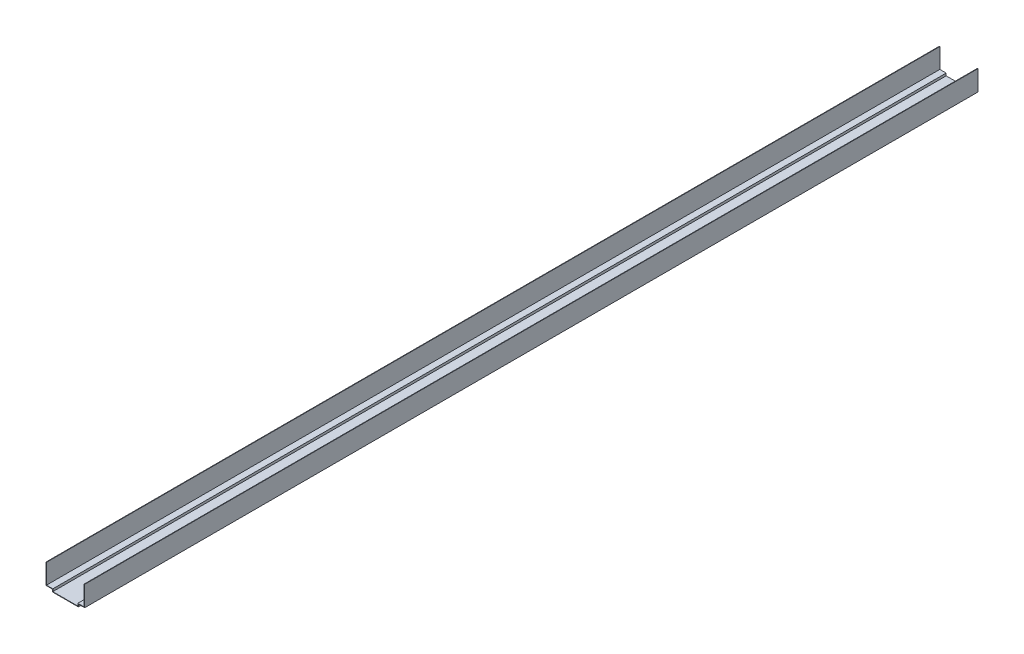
ISO-10303-21;
HEADER;
FILE_DESCRIPTION(('STEP AP214'),'2;1');
FILE_NAME('part.step','',(''),(''),'','','');
FILE_SCHEMA(('AUTOMOTIVE_DESIGN { 1 0 10303 214 1 1 1 1 }'));
ENDSEC;
DATA;
#1=APPLICATION_CONTEXT('core data for automotive mechanical design processes');
#2=APPLICATION_PROTOCOL_DEFINITION('international standard','automotive_design',2000,#1);
#3=PRODUCT_CONTEXT('',#1,'mechanical');
#4=PRODUCT('Part','Part','',(#3));
#5=PRODUCT_RELATED_PRODUCT_CATEGORY('part','',(#4));
#6=PRODUCT_DEFINITION_FORMATION('','',#4);
#7=PRODUCT_DEFINITION_CONTEXT('part definition',#1,'design');
#8=PRODUCT_DEFINITION('design','',#6,#7);
#9=PRODUCT_DEFINITION_SHAPE('','',#8);
#10=(LENGTH_UNIT() NAMED_UNIT(*) SI_UNIT(.MILLI.,.METRE.));
#11=(NAMED_UNIT(*) PLANE_ANGLE_UNIT() SI_UNIT($,.RADIAN.));
#12=(NAMED_UNIT(*) SI_UNIT($,.STERADIAN.) SOLID_ANGLE_UNIT());
#13=UNCERTAINTY_MEASURE_WITH_UNIT(LENGTH_MEASURE(1.E-05),#10,'distance_accuracy_value','');
#14=(GEOMETRIC_REPRESENTATION_CONTEXT(3) GLOBAL_UNCERTAINTY_ASSIGNED_CONTEXT((#13)) GLOBAL_UNIT_ASSIGNED_CONTEXT((#10,
#11,#12)) REPRESENTATION_CONTEXT('',''));
#15=CARTESIAN_POINT('',(0.,0.,0.));
#16=DIRECTION('',(0.,0.,1.));
#17=DIRECTION('',(1.,0.,0.));
#18=AXIS2_PLACEMENT_3D('',#15,#16,#17);
#19=CARTESIAN_POINT('',(-119.,140.01,-5500.));
#20=DIRECTION('',(0.,1.,0.));
#21=DIRECTION('',(0.,0.,1.));
#22=AXIS2_PLACEMENT_3D('',#19,#20,#21);
#23=PLANE('',#22);
#24=DIRECTION('',(-1.,0.,0.));
#25=VECTOR('',#24,1.);
#26=CARTESIAN_POINT('',(-119.,140.01,0.));
#27=LINE('',#26,#25);
#28=CARTESIAN_POINT('',(-116.,140.01,0.));
#29=VERTEX_POINT('',#28);
#30=CARTESIAN_POINT('',(-119.,140.01,0.));
#31=VERTEX_POINT('',#30);
#32=EDGE_CURVE('E194',#29,#31,#27,.T.);
#33=ORIENTED_EDGE('',*,*,#32,.F.);
#34=DIRECTION('',(0.,0.,1.));
#35=VECTOR('',#34,1.);
#36=CARTESIAN_POINT('',(-116.,140.01,-5500.));
#37=LINE('',#36,#35);
#38=CARTESIAN_POINT('',(-116.,140.01,-5500.));
#39=VERTEX_POINT('',#38);
#40=EDGE_CURVE('E11',#39,#29,#37,.T.);
#41=ORIENTED_EDGE('',*,*,#40,.F.);
#42=DIRECTION('',(-1.,0.,0.));
#43=VECTOR('',#42,1.);
#44=CARTESIAN_POINT('',(-119.,140.01,-5500.));
#45=LINE('',#44,#43);
#46=CARTESIAN_POINT('',(-119.,140.01,-5500.));
#47=VERTEX_POINT('',#46);
#48=EDGE_CURVE('E244',#39,#47,#45,.T.);
#49=ORIENTED_EDGE('',*,*,#48,.T.);
#50=DIRECTION('',(0.,0.,1.));
#51=VECTOR('',#50,1.);
#52=CARTESIAN_POINT('',(-119.,140.01,-5500.));
#53=LINE('',#52,#51);
#54=EDGE_CURVE('E46',#47,#31,#53,.T.);
#55=ORIENTED_EDGE('',*,*,#54,.T.);
#56=EDGE_LOOP('',(#33,#41,#49,#55));
#57=FACE_BOUND('',#56,.T.);
#58=ADVANCED_FACE('F43',(#57),#23,.T.);
#59=CARTESIAN_POINT('',(-116.,140.01,-5500.));
#60=DIRECTION('',(1.,0.,0.));
#61=DIRECTION('',(0.,1.,0.));
#62=AXIS2_PLACEMENT_3D('',#59,#60,#61);
#63=PLANE('',#62);
#64=DIRECTION('',(0.,1.,0.));
#65=VECTOR('',#64,1.);
#66=CARTESIAN_POINT('',(-116.,140.01,0.));
#67=LINE('',#66,#65);
#68=CARTESIAN_POINT('',(-116.,18.,0.));
#69=VERTEX_POINT('',#68);
#70=EDGE_CURVE('E241',#69,#29,#67,.T.);
#71=ORIENTED_EDGE('',*,*,#70,.F.);
#72=DIRECTION('',(0.,0.,1.));
#73=VECTOR('',#72,1.);
#74=CARTESIAN_POINT('',(-116.,18.,-5500.));
#75=LINE('',#74,#73);
#76=CARTESIAN_POINT('',(-116.,18.,-5500.));
#77=VERTEX_POINT('',#76);
#78=EDGE_CURVE('E53',#77,#69,#75,.T.);
#79=ORIENTED_EDGE('',*,*,#78,.F.);
#80=DIRECTION('',(0.,1.,0.));
#81=VECTOR('',#80,1.);
#82=CARTESIAN_POINT('',(-116.,140.01,-5500.));
#83=LINE('',#82,#81);
#84=EDGE_CURVE('E184',#77,#39,#83,.T.);
#85=ORIENTED_EDGE('',*,*,#84,.T.);
#86=ORIENTED_EDGE('',*,*,#40,.T.);
#87=EDGE_LOOP('',(#71,#79,#85,#86));
#88=FACE_BOUND('',#87,.T.);
#89=ADVANCED_FACE('F286',(#88),#63,.T.);
#90=CARTESIAN_POINT('',(-116.,18.,-5500.));
#91=DIRECTION('',(0.,1.,0.));
#92=DIRECTION('',(0.,0.,1.));
#93=AXIS2_PLACEMENT_3D('',#90,#91,#92);
#94=PLANE('',#93);
#95=DIRECTION('',(-1.,0.,0.));
#96=VECTOR('',#95,1.);
#97=CARTESIAN_POINT('',(-116.,18.,0.));
#98=LINE('',#97,#96);
#99=CARTESIAN_POINT('',(-77.,18.,0.));
#100=VERTEX_POINT('',#99);
#101=EDGE_CURVE('E170',#100,#69,#98,.T.);
#102=ORIENTED_EDGE('',*,*,#101,.F.);
#103=DIRECTION('',(0.,0.,1.));
#104=VECTOR('',#103,1.);
#105=CARTESIAN_POINT('',(-77.,18.,-5500.));
#106=LINE('',#105,#104);
#107=CARTESIAN_POINT('',(-77.,18.,-5500.));
#108=VERTEX_POINT('',#107);
#109=EDGE_CURVE('E165',#108,#100,#106,.T.);
#110=ORIENTED_EDGE('',*,*,#109,.F.);
#111=DIRECTION('',(-1.,0.,0.));
#112=VECTOR('',#111,1.);
#113=CARTESIAN_POINT('',(-116.,18.,-5500.));
#114=LINE('',#113,#112);
#115=EDGE_CURVE('E168',#108,#77,#114,.T.);
#116=ORIENTED_EDGE('',*,*,#115,.T.);
#117=ORIENTED_EDGE('',*,*,#78,.T.);
#118=EDGE_LOOP('',(#102,#110,#116,#117));
#119=FACE_BOUND('',#118,.T.);
#120=ADVANCED_FACE('F167',(#119),#94,.T.);
#121=CARTESIAN_POINT('',(-77.,18.,-5500.));
#122=DIRECTION('',(1.,0.,0.));
#123=DIRECTION('',(0.,0.,-1.));
#124=AXIS2_PLACEMENT_3D('',#121,#122,#123);
#125=PLANE('',#124);
#126=DIRECTION('',(0.,1.,0.));
#127=VECTOR('',#126,1.);
#128=CARTESIAN_POINT('',(-77.,18.,0.));
#129=LINE('',#128,#127);
#130=CARTESIAN_POINT('',(-77.,3.,0.));
#131=VERTEX_POINT('',#130);
#132=EDGE_CURVE('E238',#131,#100,#129,.T.);
#133=ORIENTED_EDGE('',*,*,#132,.F.);
#134=DIRECTION('',(0.,0.,1.));
#135=VECTOR('',#134,1.);
#136=CARTESIAN_POINT('',(-77.,3.,-5500.));
#137=LINE('',#136,#135);
#138=CARTESIAN_POINT('',(-77.,3.,-5500.));
#139=VERTEX_POINT('',#138);
#140=EDGE_CURVE('E176',#139,#131,#137,.T.);
#141=ORIENTED_EDGE('',*,*,#140,.F.);
#142=DIRECTION('',(0.,1.,0.));
#143=VECTOR('',#142,1.);
#144=CARTESIAN_POINT('',(-77.,18.,-5500.));
#145=LINE('',#144,#143);
#146=EDGE_CURVE('E182',#139,#108,#145,.T.);
#147=ORIENTED_EDGE('',*,*,#146,.T.);
#148=ORIENTED_EDGE('',*,*,#109,.T.);
#149=EDGE_LOOP('',(#133,#141,#147,#148));
#150=FACE_BOUND('',#149,.T.);
#151=ADVANCED_FACE('F186',(#150),#125,.T.);
#152=CARTESIAN_POINT('',(-77.,3.,-5500.));
#153=DIRECTION('',(0.,1.,0.));
#154=DIRECTION('',(-1.,0.,0.));
#155=AXIS2_PLACEMENT_3D('',#152,#153,#154);
#156=PLANE('',#155);
#157=DIRECTION('',(-1.,0.,0.));
#158=VECTOR('',#157,1.);
#159=CARTESIAN_POINT('',(-77.,3.,0.));
#160=LINE('',#159,#158);
#161=CARTESIAN_POINT('',(77.,3.,0.));
#162=VERTEX_POINT('',#161);
#163=EDGE_CURVE('E235',#162,#131,#160,.T.);
#164=ORIENTED_EDGE('',*,*,#163,.F.);
#165=DIRECTION('',(0.,0.,1.));
#166=VECTOR('',#165,1.);
#167=CARTESIAN_POINT('',(77.,3.,-5500.));
#168=LINE('',#167,#166);
#169=CARTESIAN_POINT('',(77.,3.,-5500.));
#170=VERTEX_POINT('',#169);
#171=EDGE_CURVE('E250',#170,#162,#168,.T.);
#172=ORIENTED_EDGE('',*,*,#171,.F.);
#173=DIRECTION('',(-1.,0.,0.));
#174=VECTOR('',#173,1.);
#175=CARTESIAN_POINT('',(-77.,3.,-5500.));
#176=LINE('',#175,#174);
#177=EDGE_CURVE('E187',#170,#139,#176,.T.);
#178=ORIENTED_EDGE('',*,*,#177,.T.);
#179=ORIENTED_EDGE('',*,*,#140,.T.);
#180=EDGE_LOOP('',(#164,#172,#178,#179));
#181=FACE_BOUND('',#180,.T.);
#182=ADVANCED_FACE('F299',(#181),#156,.T.);
#183=CARTESIAN_POINT('',(77.,18.,-5500.));
#184=DIRECTION('',(-1.,0.,0.));
#185=DIRECTION('',(0.,0.,1.));
#186=AXIS2_PLACEMENT_3D('',#183,#184,#185);
#187=PLANE('',#186);
#188=DIRECTION('',(0.,-1.,0.));
#189=VECTOR('',#188,1.);
#190=CARTESIAN_POINT('',(77.,18.,0.));
#191=LINE('',#190,#189);
#192=CARTESIAN_POINT('',(77.,18.,0.));
#193=VERTEX_POINT('',#192);
#194=EDGE_CURVE('E232',#193,#162,#191,.T.);
#195=ORIENTED_EDGE('',*,*,#194,.F.);
#196=DIRECTION('',(0.,0.,1.));
#197=VECTOR('',#196,1.);
#198=CARTESIAN_POINT('',(77.,18.,-5500.));
#199=LINE('',#198,#197);
#200=CARTESIAN_POINT('',(77.,18.,-5500.));
#201=VERTEX_POINT('',#200);
#202=EDGE_CURVE('E253',#201,#193,#199,.T.);
#203=ORIENTED_EDGE('',*,*,#202,.F.);
#204=DIRECTION('',(0.,-1.,0.));
#205=VECTOR('',#204,1.);
#206=CARTESIAN_POINT('',(77.,18.,-5500.));
#207=LINE('',#206,#205);
#208=EDGE_CURVE('E189',#201,#170,#207,.T.);
#209=ORIENTED_EDGE('',*,*,#208,.T.);
#210=ORIENTED_EDGE('',*,*,#171,.T.);
#211=EDGE_LOOP('',(#195,#203,#209,#210));
#212=FACE_BOUND('',#211,.T.);
#213=ADVANCED_FACE('F302',(#212),#187,.T.);
#214=CARTESIAN_POINT('',(116.,18.,-5500.));
#215=DIRECTION('',(0.,1.,0.));
#216=DIRECTION('',(-1.,0.,0.));
#217=AXIS2_PLACEMENT_3D('',#214,#215,#216);
#218=PLANE('',#217);
#219=DIRECTION('',(-1.,0.,0.));
#220=VECTOR('',#219,1.);
#221=CARTESIAN_POINT('',(116.,18.,0.));
#222=LINE('',#221,#220);
#223=CARTESIAN_POINT('',(116.,18.,0.));
#224=VERTEX_POINT('',#223);
#225=EDGE_CURVE('E229',#224,#193,#222,.T.);
#226=ORIENTED_EDGE('',*,*,#225,.F.);
#227=DIRECTION('',(0.,0.,1.));
#228=VECTOR('',#227,1.);
#229=CARTESIAN_POINT('',(116.,18.,-5500.));
#230=LINE('',#229,#228);
#231=CARTESIAN_POINT('',(116.,18.,-5500.));
#232=VERTEX_POINT('',#231);
#233=EDGE_CURVE('E256',#232,#224,#230,.T.);
#234=ORIENTED_EDGE('',*,*,#233,.F.);
#235=DIRECTION('',(-1.,0.,0.));
#236=VECTOR('',#235,1.);
#237=CARTESIAN_POINT('',(116.,18.,-5500.));
#238=LINE('',#237,#236);
#239=EDGE_CURVE('E487',#232,#201,#238,.T.);
#240=ORIENTED_EDGE('',*,*,#239,.T.);
#241=ORIENTED_EDGE('',*,*,#202,.T.);
#242=EDGE_LOOP('',(#226,#234,#240,#241));
#243=FACE_BOUND('',#242,.T.);
#244=ADVANCED_FACE('F306',(#243),#218,.T.);
#245=CARTESIAN_POINT('',(116.,140.01,-5500.));
#246=DIRECTION('',(-1.,0.,0.));
#247=DIRECTION('',(0.,-1.,0.));
#248=AXIS2_PLACEMENT_3D('',#245,#246,#247);
#249=PLANE('',#248);
#250=DIRECTION('',(0.,-1.,0.));
#251=VECTOR('',#250,1.);
#252=CARTESIAN_POINT('',(116.,140.01,0.));
#253=LINE('',#252,#251);
#254=CARTESIAN_POINT('',(116.,140.01,0.));
#255=VERTEX_POINT('',#254);
#256=EDGE_CURVE('E225',#255,#224,#253,.T.);
#257=ORIENTED_EDGE('',*,*,#256,.F.);
#258=DIRECTION('',(0.,0.,1.));
#259=VECTOR('',#258,1.);
#260=CARTESIAN_POINT('',(116.,140.01,-5500.));
#261=LINE('',#260,#259);
#262=CARTESIAN_POINT('',(116.,140.01,-5500.));
#263=VERTEX_POINT('',#262);
#264=EDGE_CURVE('E259',#263,#255,#261,.T.);
#265=ORIENTED_EDGE('',*,*,#264,.F.);
#266=DIRECTION('',(0.,-1.,0.));
#267=VECTOR('',#266,1.);
#268=CARTESIAN_POINT('',(116.,140.01,-5500.));
#269=LINE('',#268,#267);
#270=EDGE_CURVE('E483',#263,#232,#269,.T.);
#271=ORIENTED_EDGE('',*,*,#270,.T.);
#272=ORIENTED_EDGE('',*,*,#233,.T.);
#273=EDGE_LOOP('',(#257,#265,#271,#272));
#274=FACE_BOUND('',#273,.T.);
#275=ADVANCED_FACE('F310',(#274),#249,.T.);
#276=CARTESIAN_POINT('',(116.,140.01,-5500.));
#277=DIRECTION('',(0.,1.,0.));
#278=DIRECTION('',(0.,0.,1.));
#279=AXIS2_PLACEMENT_3D('',#276,#277,#278);
#280=PLANE('',#279);
#281=DIRECTION('',(-1.,0.,0.));
#282=VECTOR('',#281,1.);
#283=CARTESIAN_POINT('',(116.,140.01,0.));
#284=LINE('',#283,#282);
#285=CARTESIAN_POINT('',(119.,140.01,0.));
#286=VERTEX_POINT('',#285);
#287=EDGE_CURVE('E221',#286,#255,#284,.T.);
#288=ORIENTED_EDGE('',*,*,#287,.F.);
#289=DIRECTION('',(0.,0.,1.));
#290=VECTOR('',#289,1.);
#291=CARTESIAN_POINT('',(119.,140.01,-5500.));
#292=LINE('',#291,#290);
#293=CARTESIAN_POINT('',(119.,140.01,-5500.));
#294=VERTEX_POINT('',#293);
#295=EDGE_CURVE('E262',#294,#286,#292,.T.);
#296=ORIENTED_EDGE('',*,*,#295,.F.);
#297=DIRECTION('',(-1.,0.,0.));
#298=VECTOR('',#297,1.);
#299=CARTESIAN_POINT('',(116.,140.01,-5500.));
#300=LINE('',#299,#298);
#301=EDGE_CURVE('E494',#294,#263,#300,.T.);
#302=ORIENTED_EDGE('',*,*,#301,.T.);
#303=ORIENTED_EDGE('',*,*,#264,.T.);
#304=EDGE_LOOP('',(#288,#296,#302,#303));
#305=FACE_BOUND('',#304,.T.);
#306=ADVANCED_FACE('F314',(#305),#280,.T.);
#307=CARTESIAN_POINT('',(119.,140.01,-5500.));
#308=DIRECTION('',(1.,0.,0.));
#309=DIRECTION('',(0.,1.,0.));
#310=AXIS2_PLACEMENT_3D('',#307,#308,#309);
#311=PLANE('',#310);
#312=DIRECTION('',(0.,1.,0.));
#313=VECTOR('',#312,1.);
#314=CARTESIAN_POINT('',(119.,140.01,0.));
#315=LINE('',#314,#313);
#316=CARTESIAN_POINT('',(119.,15.,0.));
#317=VERTEX_POINT('',#316);
#318=EDGE_CURVE('E217',#317,#286,#315,.T.);
#319=ORIENTED_EDGE('',*,*,#318,.F.);
#320=DIRECTION('',(0.,0.,1.));
#321=VECTOR('',#320,1.);
#322=CARTESIAN_POINT('',(119.,15.,-5500.));
#323=LINE('',#322,#321);
#324=CARTESIAN_POINT('',(119.,15.,-5500.));
#325=VERTEX_POINT('',#324);
#326=EDGE_CURVE('E265',#325,#317,#323,.T.);
#327=ORIENTED_EDGE('',*,*,#326,.F.);
#328=DIRECTION('',(0.,1.,0.));
#329=VECTOR('',#328,1.);
#330=CARTESIAN_POINT('',(119.,140.01,-5500.));
#331=LINE('',#330,#329);
#332=EDGE_CURVE('E476',#325,#294,#331,.T.);
#333=ORIENTED_EDGE('',*,*,#332,.T.);
#334=ORIENTED_EDGE('',*,*,#295,.T.);
#335=EDGE_LOOP('',(#319,#327,#333,#334));
#336=FACE_BOUND('',#335,.T.);
#337=ADVANCED_FACE('F318',(#336),#311,.T.);
#338=CARTESIAN_POINT('',(119.,15.,-5500.));
#339=DIRECTION('',(0.,-1.,0.));
#340=DIRECTION('',(1.,0.,0.));
#341=AXIS2_PLACEMENT_3D('',#338,#339,#340);
#342=PLANE('',#341);
#343=DIRECTION('',(1.,0.,0.));
#344=VECTOR('',#343,1.);
#345=CARTESIAN_POINT('',(119.,15.,0.));
#346=LINE('',#345,#344);
#347=CARTESIAN_POINT('',(80.,15.,0.));
#348=VERTEX_POINT('',#347);
#349=EDGE_CURVE('E214',#348,#317,#346,.T.);
#350=ORIENTED_EDGE('',*,*,#349,.F.);
#351=DIRECTION('',(0.,0.,1.));
#352=VECTOR('',#351,1.);
#353=CARTESIAN_POINT('',(80.,15.,-5500.));
#354=LINE('',#353,#352);
#355=CARTESIAN_POINT('',(80.,15.,-5500.));
#356=VERTEX_POINT('',#355);
#357=EDGE_CURVE('E268',#356,#348,#354,.T.);
#358=ORIENTED_EDGE('',*,*,#357,.F.);
#359=DIRECTION('',(1.,0.,0.));
#360=VECTOR('',#359,1.);
#361=CARTESIAN_POINT('',(119.,15.,-5500.));
#362=LINE('',#361,#360);
#363=EDGE_CURVE('E472',#356,#325,#362,.T.);
#364=ORIENTED_EDGE('',*,*,#363,.T.);
#365=ORIENTED_EDGE('',*,*,#326,.T.);
#366=EDGE_LOOP('',(#350,#358,#364,#365));
#367=FACE_BOUND('',#366,.T.);
#368=ADVANCED_FACE('F322',(#367),#342,.T.);
#369=CARTESIAN_POINT('',(80.,15.,-5500.));
#370=DIRECTION('',(1.,0.,0.));
#371=DIRECTION('',(0.,0.,-1.));
#372=AXIS2_PLACEMENT_3D('',#369,#370,#371);
#373=PLANE('',#372);
#374=DIRECTION('',(0.,1.,0.));
#375=VECTOR('',#374,1.);
#376=CARTESIAN_POINT('',(80.,15.,0.));
#377=LINE('',#376,#375);
#378=CARTESIAN_POINT('',(80.,0.,0.));
#379=VERTEX_POINT('',#378);
#380=EDGE_CURVE('E211',#379,#348,#377,.T.);
#381=ORIENTED_EDGE('',*,*,#380,.F.);
#382=DIRECTION('',(0.,0.,1.));
#383=VECTOR('',#382,1.);
#384=CARTESIAN_POINT('',(80.,0.,-5500.));
#385=LINE('',#384,#383);
#386=CARTESIAN_POINT('',(80.,0.,-5500.));
#387=VERTEX_POINT('',#386);
#388=EDGE_CURVE('E271',#387,#379,#385,.T.);
#389=ORIENTED_EDGE('',*,*,#388,.F.);
#390=DIRECTION('',(0.,1.,0.));
#391=VECTOR('',#390,1.);
#392=CARTESIAN_POINT('',(80.,15.,-5500.));
#393=LINE('',#392,#391);
#394=EDGE_CURVE('E498',#387,#356,#393,.T.);
#395=ORIENTED_EDGE('',*,*,#394,.T.);
#396=ORIENTED_EDGE('',*,*,#357,.T.);
#397=EDGE_LOOP('',(#381,#389,#395,#396));
#398=FACE_BOUND('',#397,.T.);
#399=ADVANCED_FACE('F326',(#398),#373,.T.);
#400=CARTESIAN_POINT('',(-80.,0.,-5500.));
#401=DIRECTION('',(0.,-1.,0.));
#402=DIRECTION('',(1.,0.,0.));
#403=AXIS2_PLACEMENT_3D('',#400,#401,#402);
#404=PLANE('',#403);
#405=DIRECTION('',(1.,0.,0.));
#406=VECTOR('',#405,1.);
#407=CARTESIAN_POINT('',(-80.,0.,0.));
#408=LINE('',#407,#406);
#409=CARTESIAN_POINT('',(-80.,0.,0.));
#410=VERTEX_POINT('',#409);
#411=EDGE_CURVE('E208',#410,#379,#408,.T.);
#412=ORIENTED_EDGE('',*,*,#411,.F.);
#413=DIRECTION('',(0.,0.,1.));
#414=VECTOR('',#413,1.);
#415=CARTESIAN_POINT('',(-80.,0.,-5500.));
#416=LINE('',#415,#414);
#417=CARTESIAN_POINT('',(-80.,0.,-5500.));
#418=VERTEX_POINT('',#417);
#419=EDGE_CURVE('E274',#418,#410,#416,.T.);
#420=ORIENTED_EDGE('',*,*,#419,.F.);
#421=DIRECTION('',(1.,0.,0.));
#422=VECTOR('',#421,1.);
#423=CARTESIAN_POINT('',(-80.,0.,-5500.));
#424=LINE('',#423,#422);
#425=EDGE_CURVE('E465',#418,#387,#424,.T.);
#426=ORIENTED_EDGE('',*,*,#425,.T.);
#427=ORIENTED_EDGE('',*,*,#388,.T.);
#428=EDGE_LOOP('',(#412,#420,#426,#427));
#429=FACE_BOUND('',#428,.T.);
#430=ADVANCED_FACE('F330',(#429),#404,.T.);
#431=CARTESIAN_POINT('',(-80.,15.,-5500.));
#432=DIRECTION('',(-1.,0.,0.));
#433=DIRECTION('',(0.,0.,1.));
#434=AXIS2_PLACEMENT_3D('',#431,#432,#433);
#435=PLANE('',#434);
#436=DIRECTION('',(0.,-1.,0.));
#437=VECTOR('',#436,1.);
#438=CARTESIAN_POINT('',(-80.,15.,0.));
#439=LINE('',#438,#437);
#440=CARTESIAN_POINT('',(-80.,15.,0.));
#441=VERTEX_POINT('',#440);
#442=EDGE_CURVE('E205',#441,#410,#439,.T.);
#443=ORIENTED_EDGE('',*,*,#442,.F.);
#444=DIRECTION('',(0.,0.,1.));
#445=VECTOR('',#444,1.);
#446=CARTESIAN_POINT('',(-80.,15.,-5500.));
#447=LINE('',#446,#445);
#448=CARTESIAN_POINT('',(-80.,15.,-5500.));
#449=VERTEX_POINT('',#448);
#450=EDGE_CURVE('E277',#449,#441,#447,.T.);
#451=ORIENTED_EDGE('',*,*,#450,.F.);
#452=DIRECTION('',(0.,-1.,0.));
#453=VECTOR('',#452,1.);
#454=CARTESIAN_POINT('',(-80.,15.,-5500.));
#455=LINE('',#454,#453);
#456=EDGE_CURVE('E461',#449,#418,#455,.T.);
#457=ORIENTED_EDGE('',*,*,#456,.T.);
#458=ORIENTED_EDGE('',*,*,#419,.T.);
#459=EDGE_LOOP('',(#443,#451,#457,#458));
#460=FACE_BOUND('',#459,.T.);
#461=ADVANCED_FACE('F334',(#460),#435,.T.);
#462=CARTESIAN_POINT('',(-119.,15.,-5500.));
#463=DIRECTION('',(0.,-1.,0.));
#464=DIRECTION('',(0.,0.,-1.));
#465=AXIS2_PLACEMENT_3D('',#462,#463,#464);
#466=PLANE('',#465);
#467=DIRECTION('',(1.,0.,0.));
#468=VECTOR('',#467,1.);
#469=CARTESIAN_POINT('',(-119.,15.,0.));
#470=LINE('',#469,#468);
#471=CARTESIAN_POINT('',(-119.,15.,0.));
#472=VERTEX_POINT('',#471);
#473=EDGE_CURVE('E202',#472,#441,#470,.T.);
#474=ORIENTED_EDGE('',*,*,#473,.F.);
#475=DIRECTION('',(0.,0.,1.));
#476=VECTOR('',#475,1.);
#477=CARTESIAN_POINT('',(-119.,15.,-5500.));
#478=LINE('',#477,#476);
#479=CARTESIAN_POINT('',(-119.,15.,-5500.));
#480=VERTEX_POINT('',#479);
#481=EDGE_CURVE('E279',#480,#472,#478,.T.);
#482=ORIENTED_EDGE('',*,*,#481,.F.);
#483=DIRECTION('',(1.,0.,0.));
#484=VECTOR('',#483,1.);
#485=CARTESIAN_POINT('',(-119.,15.,-5500.));
#486=LINE('',#485,#484);
#487=EDGE_CURVE('E502',#480,#449,#486,.T.);
#488=ORIENTED_EDGE('',*,*,#487,.T.);
#489=ORIENTED_EDGE('',*,*,#450,.T.);
#490=EDGE_LOOP('',(#474,#482,#488,#489));
#491=FACE_BOUND('',#490,.T.);
#492=ADVANCED_FACE('F338',(#491),#466,.T.);
#493=CARTESIAN_POINT('',(-119.,140.01,-5500.));
#494=DIRECTION('',(-1.,0.,0.));
#495=DIRECTION('',(0.,-1.,0.));
#496=AXIS2_PLACEMENT_3D('',#493,#494,#495);
#497=PLANE('',#496);
#498=DIRECTION('',(0.,-1.,0.));
#499=VECTOR('',#498,1.);
#500=CARTESIAN_POINT('',(-119.,140.01,0.));
#501=LINE('',#500,#499);
#502=EDGE_CURVE('E198',#31,#472,#501,.T.);
#503=ORIENTED_EDGE('',*,*,#502,.F.);
#504=ORIENTED_EDGE('',*,*,#54,.F.);
#505=DIRECTION('',(0.,-1.,0.));
#506=VECTOR('',#505,1.);
#507=CARTESIAN_POINT('',(-119.,140.01,-5500.));
#508=LINE('',#507,#506);
#509=EDGE_CURVE('E504',#47,#480,#508,.T.);
#510=ORIENTED_EDGE('',*,*,#509,.T.);
#511=ORIENTED_EDGE('',*,*,#481,.T.);
#512=EDGE_LOOP('',(#503,#504,#510,#511));
#513=FACE_BOUND('',#512,.T.);
#514=ADVANCED_FACE('F283',(#513),#497,.T.);
#515=CARTESIAN_POINT('',(-77.,140.01,-5500.));
#516=DIRECTION('',(0.,0.,-1.));
#517=DIRECTION('',(-1.,0.,0.));
#518=AXIS2_PLACEMENT_3D('',#515,#516,#517);
#519=PLANE('',#518);
#520=ORIENTED_EDGE('',*,*,#48,.F.);
#521=ORIENTED_EDGE('',*,*,#84,.F.);
#522=ORIENTED_EDGE('',*,*,#115,.F.);
#523=ORIENTED_EDGE('',*,*,#146,.F.);
#524=ORIENTED_EDGE('',*,*,#177,.F.);
#525=ORIENTED_EDGE('',*,*,#208,.F.);
#526=ORIENTED_EDGE('',*,*,#239,.F.);
#527=ORIENTED_EDGE('',*,*,#270,.F.);
#528=ORIENTED_EDGE('',*,*,#301,.F.);
#529=ORIENTED_EDGE('',*,*,#332,.F.);
#530=ORIENTED_EDGE('',*,*,#363,.F.);
#531=ORIENTED_EDGE('',*,*,#394,.F.);
#532=ORIENTED_EDGE('',*,*,#425,.F.);
#533=ORIENTED_EDGE('',*,*,#456,.F.);
#534=ORIENTED_EDGE('',*,*,#487,.F.);
#535=ORIENTED_EDGE('',*,*,#509,.F.);
#536=EDGE_LOOP('',(#520,#521,#522,#523,#524,#525,#526,#527,#528,#529,#530,#531,#532,#533,#534,#535));
#537=FACE_BOUND('',#536,.T.);
#538=ADVANCED_FACE('F180',(#537),#519,.T.);
#539=CARTESIAN_POINT('',(-77.,140.01,0.));
#540=DIRECTION('',(0.,0.,-1.));
#541=DIRECTION('',(-1.,0.,0.));
#542=AXIS2_PLACEMENT_3D('',#539,#540,#541);
#543=PLANE('',#542);
#544=ORIENTED_EDGE('',*,*,#32,.T.);
#545=ORIENTED_EDGE('',*,*,#502,.T.);
#546=ORIENTED_EDGE('',*,*,#473,.T.);
#547=ORIENTED_EDGE('',*,*,#442,.T.);
#548=ORIENTED_EDGE('',*,*,#411,.T.);
#549=ORIENTED_EDGE('',*,*,#380,.T.);
#550=ORIENTED_EDGE('',*,*,#349,.T.);
#551=ORIENTED_EDGE('',*,*,#318,.T.);
#552=ORIENTED_EDGE('',*,*,#287,.T.);
#553=ORIENTED_EDGE('',*,*,#256,.T.);
#554=ORIENTED_EDGE('',*,*,#225,.T.);
#555=ORIENTED_EDGE('',*,*,#194,.T.);
#556=ORIENTED_EDGE('',*,*,#163,.T.);
#557=ORIENTED_EDGE('',*,*,#132,.T.);
#558=ORIENTED_EDGE('',*,*,#101,.T.);
#559=ORIENTED_EDGE('',*,*,#70,.T.);
#560=EDGE_LOOP('',(#544,#545,#546,#547,#548,#549,#550,#551,#552,#553,#554,#555,#556,#557,#558,#559));
#561=FACE_BOUND('',#560,.T.);
#562=ADVANCED_FACE('F285',(#561),#543,.F.);
#563=CLOSED_SHELL('',(#58,#89,#120,#151,#182,#213,#244,#275,#306,#337,#368,#399,#430,#461,#492,
#514,#538,#562));
#564=MANIFOLD_SOLID_BREP('B2',#563);
#565=ADVANCED_BREP_SHAPE_REPRESENTATION('',(#18,#564),#14);
#566=SHAPE_DEFINITION_REPRESENTATION(#9,#565);
ENDSEC;
END-ISO-10303-21;
